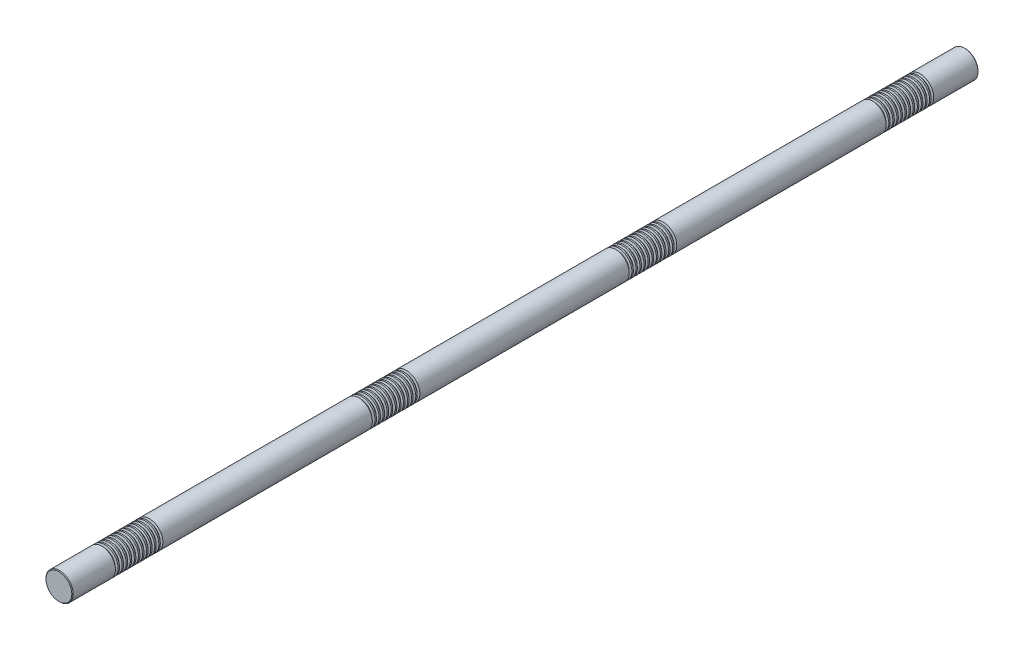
from build123d import *

# Parameters (mm, degrees)
SKETCH1_R           = 30
BOSS_EXTRUDE1_DEPTH = 1000
CHAMFER1_SIZE       = 1.5
LPATTERN1_COUNT     = 12
LPATTERN1_PITCH     = 9
LPATTERN2_COUNT     = 4
LPATTERN2_PITCH     = 567


with BuildPart() as part:
    # Sketch1 → Boss-Extrude1 (new, symmetric)
    with BuildSketch(Plane.XY):
        Circle(SKETCH1_R)
    extrude(amount=BOSS_EXTRUDE1_DEPTH, both=True)

    # Chamfer1
    chamfer1_edges = [part.edges().sort_by_distance(p)[0] for p in [
        (-30, 0, -1000),
        (-30, 0, 1000),
    ]]
    chamfer(chamfer1_edges, length=CHAMFER1_SIZE)

    # Sketch2 → Cut-Revolve1 (revolve, cut)
    with BuildSketch(Plane(origin=(0, 0, 0), x_dir=(0, 0, -1), z_dir=(1, 0, 0)), mode=Mode.PRIVATE) as cut_revolve1_sk:
        Polygon((900.669872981, 30), (894.830127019, 30), (896.169872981, 25), (899.330127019, 25), align=None)
    cut_revolve1 = revolve(cut_revolve1_sk.sketch.rotate(Axis((0, 0, 1000), (0, 0, -1)), 90), axis=Axis((0, 0, 1000), (0, 0, -1)), mode=Mode.SUBTRACT)

    # LPattern1: Cut-Revolve1 ×12
    with Locations(*[(0, 0, i * LPATTERN1_PITCH) for i in range(1, LPATTERN1_COUNT)]):
        add(cut_revolve1, mode=Mode.SUBTRACT)

    # LPattern2: Cut-Revolve1 ×4
    with Locations(*[(0, 0, i * LPATTERN2_PITCH) for i in range(1, LPATTERN2_COUNT)]):
        add(cut_revolve1, mode=Mode.SUBTRACT)

    # LPattern2 copy 1 sketch → LPattern2 copy 1 (revolve, cut)
    with BuildSketch(Plane(origin=(0, 0, 576), x_dir=(0, 0, -1), z_dir=(1, 0, 0))):
        Polygon((900.669872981, 30), (894.830127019, 30), (896.169872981, 25), (899.330127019, 25), align=None)
    revolve(axis=Axis((0, 0, 1576), (0, 0, -1)), mode=Mode.SUBTRACT)

    # LPattern2 copy 2 sketch → LPattern2 copy 2 (revolve, cut)
    with BuildSketch(Plane(origin=(0, 0, 1143), x_dir=(0, 0, -1), z_dir=(1, 0, 0))):
        Polygon((900.669872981, 30), (894.830127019, 30), (896.169872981, 25), (899.330127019, 25), align=None)
    revolve(axis=Axis((0, 0, 2143), (0, 0, -1)), mode=Mode.SUBTRACT)

    # LPattern2 copy 3 sketch → LPattern2 copy 3 (revolve, cut)
    with BuildSketch(Plane(origin=(0, 0, 1710), x_dir=(0, 0, -1), z_dir=(1, 0, 0))):
        Polygon((900.669872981, 30), (894.830127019, 30), (896.169872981, 25), (899.330127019, 25), align=None)
    revolve(axis=Axis((0, 0, 2710), (0, 0, -1)), mode=Mode.SUBTRACT)

    # LPattern2 copy 4 sketch → LPattern2 copy 4 (revolve, cut)
    with BuildSketch(Plane(origin=(0, 0, 585), x_dir=(0, 0, -1), z_dir=(1, 0, 0))):
        Polygon((900.669872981, 30), (894.830127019, 30), (896.169872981, 25), (899.330127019, 25), align=None)
    revolve(axis=Axis((0, 0, 1585), (0, 0, -1)), mode=Mode.SUBTRACT)

    # LPattern2 copy 5 sketch → LPattern2 copy 5 (revolve, cut)
    with BuildSketch(Plane(origin=(0, 0, 1152), x_dir=(0, 0, -1), z_dir=(1, 0, 0))):
        Polygon((900.669872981, 30), (894.830127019, 30), (896.169872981, 25), (899.330127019, 25), align=None)
    revolve(axis=Axis((0, 0, 2152), (0, 0, -1)), mode=Mode.SUBTRACT)

    # LPattern2 copy 6 sketch → LPattern2 copy 6 (revolve, cut)
    with BuildSketch(Plane(origin=(0, 0, 1719), x_dir=(0, 0, -1), z_dir=(1, 0, 0))):
        Polygon((900.669872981, 30), (894.830127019, 30), (896.169872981, 25), (899.330127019, 25), align=None)
    revolve(axis=Axis((0, 0, 2719), (0, 0, -1)), mode=Mode.SUBTRACT)

    # LPattern2 copy 7 sketch → LPattern2 copy 7 (revolve, cut)
    with BuildSketch(Plane(origin=(0, 0, 594), x_dir=(0, 0, -1), z_dir=(1, 0, 0))):
        Polygon((900.669872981, 30), (894.830127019, 30), (896.169872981, 25), (899.330127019, 25), align=None)
    revolve(axis=Axis((0, 0, 1594), (0, 0, -1)), mode=Mode.SUBTRACT)

    # LPattern2 copy 8 sketch → LPattern2 copy 8 (revolve, cut)
    with BuildSketch(Plane(origin=(0, 0, 1161), x_dir=(0, 0, -1), z_dir=(1, 0, 0))):
        Polygon((900.669872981, 30), (894.830127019, 30), (896.169872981, 25), (899.330127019, 25), align=None)
    revolve(axis=Axis((0, 0, 2161), (0, 0, -1)), mode=Mode.SUBTRACT)

    # LPattern2 copy 9 sketch → LPattern2 copy 9 (revolve, cut)
    with BuildSketch(Plane(origin=(0, 0, 1728), x_dir=(0, 0, -1), z_dir=(1, 0, 0))):
        Polygon((900.669872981, 30), (894.830127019, 30), (896.169872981, 25), (899.330127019, 25), align=None)
    revolve(axis=Axis((0, 0, 2728), (0, 0, -1)), mode=Mode.SUBTRACT)

    # LPattern2 copy 10 sketch → LPattern2 copy 10 (revolve, cut)
    with BuildSketch(Plane(origin=(0, 0, 603), x_dir=(0, 0, -1), z_dir=(1, 0, 0))):
        Polygon((900.669872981, 30), (894.830127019, 30), (896.169872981, 25), (899.330127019, 25), align=None)
    revolve(axis=Axis((0, 0, 1603), (0, 0, -1)), mode=Mode.SUBTRACT)

    # LPattern2 copy 11 sketch → LPattern2 copy 11 (revolve, cut)
    with BuildSketch(Plane(origin=(0, 0, 1170), x_dir=(0, 0, -1), z_dir=(1, 0, 0))):
        Polygon((900.669872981, 30), (894.830127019, 30), (896.169872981, 25), (899.330127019, 25), align=None)
    revolve(axis=Axis((0, 0, 2170), (0, 0, -1)), mode=Mode.SUBTRACT)

    # LPattern2 copy 12 sketch → LPattern2 copy 12 (revolve, cut)
    with BuildSketch(Plane(origin=(0, 0, 1737), x_dir=(0, 0, -1), z_dir=(1, 0, 0))):
        Polygon((900.669872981, 30), (894.830127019, 30), (896.169872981, 25), (899.330127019, 25), align=None)
    revolve(axis=Axis((0, 0, 2737), (0, 0, -1)), mode=Mode.SUBTRACT)

    # LPattern2 copy 13 sketch → LPattern2 copy 13 (revolve, cut)
    with BuildSketch(Plane(origin=(0, 0, 612), x_dir=(0, 0, -1), z_dir=(1, 0, 0))):
        Polygon((900.669872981, 30), (894.830127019, 30), (896.169872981, 25), (899.330127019, 25), align=None)
    revolve(axis=Axis((0, 0, 1612), (0, 0, -1)), mode=Mode.SUBTRACT)

    # LPattern2 copy 14 sketch → LPattern2 copy 14 (revolve, cut)
    with BuildSketch(Plane(origin=(0, 0, 1179), x_dir=(0, 0, -1), z_dir=(1, 0, 0))):
        Polygon((900.669872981, 30), (894.830127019, 30), (896.169872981, 25), (899.330127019, 25), align=None)
    revolve(axis=Axis((0, 0, 2179), (0, 0, -1)), mode=Mode.SUBTRACT)

    # LPattern2 copy 15 sketch → LPattern2 copy 15 (revolve, cut)
    with BuildSketch(Plane(origin=(0, 0, 1746), x_dir=(0, 0, -1), z_dir=(1, 0, 0))):
        Polygon((900.669872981, 30), (894.830127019, 30), (896.169872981, 25), (899.330127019, 25), align=None)
    revolve(axis=Axis((0, 0, 2746), (0, 0, -1)), mode=Mode.SUBTRACT)

    # LPattern2 copy 16 sketch → LPattern2 copy 16 (revolve, cut)
    with BuildSketch(Plane(origin=(0, 0, 621), x_dir=(0, 0, -1), z_dir=(1, 0, 0))):
        Polygon((900.669872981, 30), (894.830127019, 30), (896.169872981, 25), (899.330127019, 25), align=None)
    revolve(axis=Axis((0, 0, 1621), (0, 0, -1)), mode=Mode.SUBTRACT)

    # LPattern2 copy 17 sketch → LPattern2 copy 17 (revolve, cut)
    with BuildSketch(Plane(origin=(0, 0, 1188), x_dir=(0, 0, -1), z_dir=(1, 0, 0))):
        Polygon((900.669872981, 30), (894.830127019, 30), (896.169872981, 25), (899.330127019, 25), align=None)
    revolve(axis=Axis((0, 0, 2188), (0, 0, -1)), mode=Mode.SUBTRACT)

    # LPattern2 copy 18 sketch → LPattern2 copy 18 (revolve, cut)
    with BuildSketch(Plane(origin=(0, 0, 1755), x_dir=(0, 0, -1), z_dir=(1, 0, 0))):
        Polygon((900.669872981, 30), (894.830127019, 30), (896.169872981, 25), (899.330127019, 25), align=None)
    revolve(axis=Axis((0, 0, 2755), (0, 0, -1)), mode=Mode.SUBTRACT)

    # LPattern2 copy 19 sketch → LPattern2 copy 19 (revolve, cut)
    with BuildSketch(Plane(origin=(0, 0, 630), x_dir=(0, 0, -1), z_dir=(1, 0, 0))):
        Polygon((900.669872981, 30), (894.830127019, 30), (896.169872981, 25), (899.330127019, 25), align=None)
    revolve(axis=Axis((0, 0, 1630), (0, 0, -1)), mode=Mode.SUBTRACT)

    # LPattern2 copy 20 sketch → LPattern2 copy 20 (revolve, cut)
    with BuildSketch(Plane(origin=(0, 0, 1197), x_dir=(0, 0, -1), z_dir=(1, 0, 0))):
        Polygon((900.669872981, 30), (894.830127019, 30), (896.169872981, 25), (899.330127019, 25), align=None)
    revolve(axis=Axis((0, 0, 2197), (0, 0, -1)), mode=Mode.SUBTRACT)

    # LPattern2 copy 21 sketch → LPattern2 copy 21 (revolve, cut)
    with BuildSketch(Plane(origin=(0, 0, 1764), x_dir=(0, 0, -1), z_dir=(1, 0, 0))):
        Polygon((900.669872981, 30), (894.830127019, 30), (896.169872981, 25), (899.330127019, 25), align=None)
    revolve(axis=Axis((0, 0, 2764), (0, 0, -1)), mode=Mode.SUBTRACT)

    # LPattern2 copy 22 sketch → LPattern2 copy 22 (revolve, cut)
    with BuildSketch(Plane(origin=(0, 0, 639), x_dir=(0, 0, -1), z_dir=(1, 0, 0))):
        Polygon((900.669872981, 30), (894.830127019, 30), (896.169872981, 25), (899.330127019, 25), align=None)
    revolve(axis=Axis((0, 0, 1639), (0, 0, -1)), mode=Mode.SUBTRACT)

    # LPattern2 copy 23 sketch → LPattern2 copy 23 (revolve, cut)
    with BuildSketch(Plane(origin=(0, 0, 1206), x_dir=(0, 0, -1), z_dir=(1, 0, 0))):
        Polygon((900.669872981, 30), (894.830127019, 30), (896.169872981, 25), (899.330127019, 25), align=None)
    revolve(axis=Axis((0, 0, 2206), (0, 0, -1)), mode=Mode.SUBTRACT)

    # LPattern2 copy 24 sketch → LPattern2 copy 24 (revolve, cut)
    with BuildSketch(Plane(origin=(0, 0, 1773), x_dir=(0, 0, -1), z_dir=(1, 0, 0))):
        Polygon((900.669872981, 30), (894.830127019, 30), (896.169872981, 25), (899.330127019, 25), align=None)
    revolve(axis=Axis((0, 0, 2773), (0, 0, -1)), mode=Mode.SUBTRACT)

    # LPattern2 copy 25 sketch → LPattern2 copy 25 (revolve, cut)
    with BuildSketch(Plane(origin=(0, 0, 648), x_dir=(0, 0, -1), z_dir=(1, 0, 0))):
        Polygon((900.669872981, 30), (894.830127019, 30), (896.169872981, 25), (899.330127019, 25), align=None)
    revolve(axis=Axis((0, 0, 1648), (0, 0, -1)), mode=Mode.SUBTRACT)

    # LPattern2 copy 26 sketch → LPattern2 copy 26 (revolve, cut)
    with BuildSketch(Plane(origin=(0, 0, 1215), x_dir=(0, 0, -1), z_dir=(1, 0, 0))):
        Polygon((900.669872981, 30), (894.830127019, 30), (896.169872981, 25), (899.330127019, 25), align=None)
    revolve(axis=Axis((0, 0, 2215), (0, 0, -1)), mode=Mode.SUBTRACT)

    # LPattern2 copy 27 sketch → LPattern2 copy 27 (revolve, cut)
    with BuildSketch(Plane(origin=(0, 0, 1782), x_dir=(0, 0, -1), z_dir=(1, 0, 0))):
        Polygon((900.669872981, 30), (894.830127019, 30), (896.169872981, 25), (899.330127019, 25), align=None)
    revolve(axis=Axis((0, 0, 2782), (0, 0, -1)), mode=Mode.SUBTRACT)

    # LPattern2 copy 28 sketch → LPattern2 copy 28 (revolve, cut)
    with BuildSketch(Plane(origin=(0, 0, 657), x_dir=(0, 0, -1), z_dir=(1, 0, 0))):
        Polygon((900.669872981, 30), (894.830127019, 30), (896.169872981, 25), (899.330127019, 25), align=None)
    revolve(axis=Axis((0, 0, 1657), (0, 0, -1)), mode=Mode.SUBTRACT)

    # LPattern2 copy 29 sketch → LPattern2 copy 29 (revolve, cut)
    with BuildSketch(Plane(origin=(0, 0, 1224), x_dir=(0, 0, -1), z_dir=(1, 0, 0))):
        Polygon((900.669872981, 30), (894.830127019, 30), (896.169872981, 25), (899.330127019, 25), align=None)
    revolve(axis=Axis((0, 0, 2224), (0, 0, -1)), mode=Mode.SUBTRACT)

    # LPattern2 copy 30 sketch → LPattern2 copy 30 (revolve, cut)
    with BuildSketch(Plane(origin=(0, 0, 1791), x_dir=(0, 0, -1), z_dir=(1, 0, 0))):
        Polygon((900.669872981, 30), (894.830127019, 30), (896.169872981, 25), (899.330127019, 25), align=None)
    revolve(axis=Axis((0, 0, 2791), (0, 0, -1)), mode=Mode.SUBTRACT)

    # LPattern2 copy 31 sketch → LPattern2 copy 31 (revolve, cut)
    with BuildSketch(Plane(origin=(0, 0, 666), x_dir=(0, 0, -1), z_dir=(1, 0, 0))):
        Polygon((900.669872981, 30), (894.830127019, 30), (896.169872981, 25), (899.330127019, 25), align=None)
    revolve(axis=Axis((0, 0, 1666), (0, 0, -1)), mode=Mode.SUBTRACT)

    # LPattern2 copy 32 sketch → LPattern2 copy 32 (revolve, cut)
    with BuildSketch(Plane(origin=(0, 0, 1233), x_dir=(0, 0, -1), z_dir=(1, 0, 0))):
        Polygon((900.669872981, 30), (894.830127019, 30), (896.169872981, 25), (899.330127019, 25), align=None)
    revolve(axis=Axis((0, 0, 2233), (0, 0, -1)), mode=Mode.SUBTRACT)

    # LPattern2 copy 33 sketch → LPattern2 copy 33 (revolve, cut)
    with BuildSketch(Plane(origin=(0, 0, 1800), x_dir=(0, 0, -1), z_dir=(1, 0, 0))):
        Polygon((900.669872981, 30), (894.830127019, 30), (896.169872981, 25), (899.330127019, 25), align=None)
    revolve(axis=Axis((0, 0, 2800), (0, 0, -1)), mode=Mode.SUBTRACT)


solid = part.part
